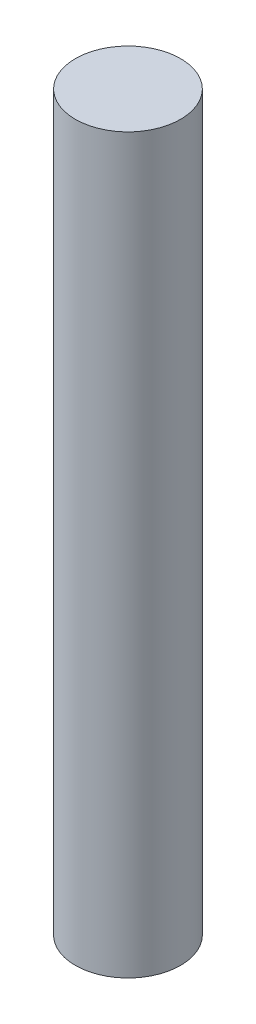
ISO-10303-21;
HEADER;
FILE_DESCRIPTION(('STEP AP214'),'2;1');
FILE_NAME('part.step','',(''),(''),'','','');
FILE_SCHEMA(('AUTOMOTIVE_DESIGN { 1 0 10303 214 1 1 1 1 }'));
ENDSEC;
DATA;
#1=APPLICATION_CONTEXT('core data for automotive mechanical design processes');
#2=APPLICATION_PROTOCOL_DEFINITION('international standard','automotive_design',2000,#1);
#3=PRODUCT_CONTEXT('',#1,'mechanical');
#4=PRODUCT('Part','Part','',(#3));
#5=PRODUCT_RELATED_PRODUCT_CATEGORY('part','',(#4));
#6=PRODUCT_DEFINITION_FORMATION('','',#4);
#7=PRODUCT_DEFINITION_CONTEXT('part definition',#1,'design');
#8=PRODUCT_DEFINITION('design','',#6,#7);
#9=PRODUCT_DEFINITION_SHAPE('','',#8);
#10=(LENGTH_UNIT() NAMED_UNIT(*) SI_UNIT(.MILLI.,.METRE.));
#11=(NAMED_UNIT(*) PLANE_ANGLE_UNIT() SI_UNIT($,.RADIAN.));
#12=(NAMED_UNIT(*) SI_UNIT($,.STERADIAN.) SOLID_ANGLE_UNIT());
#13=UNCERTAINTY_MEASURE_WITH_UNIT(LENGTH_MEASURE(1.E-05),#10,'distance_accuracy_value','');
#14=(GEOMETRIC_REPRESENTATION_CONTEXT(3) GLOBAL_UNCERTAINTY_ASSIGNED_CONTEXT((#13)) GLOBAL_UNIT_ASSIGNED_CONTEXT((#10,
#11,#12)) REPRESENTATION_CONTEXT('',''));
#15=CARTESIAN_POINT('',(0.,0.,0.));
#16=DIRECTION('',(0.,0.,1.));
#17=DIRECTION('',(1.,0.,0.));
#18=AXIS2_PLACEMENT_3D('',#15,#16,#17);
#19=CARTESIAN_POINT('',(0.,132.6642,0.));
#20=DIRECTION('',(0.,-1.,0.));
#21=DIRECTION('',(0.,0.,-1.));
#22=AXIS2_PLACEMENT_3D('',#19,#20,#21);
#23=CYLINDRICAL_SURFACE('',#22,9.525);
#24=CARTESIAN_POINT('',(0.,132.6642,0.));
#25=DIRECTION('',(0.,1.,0.));
#26=DIRECTION('',(0.,0.,1.));
#27=AXIS2_PLACEMENT_3D('',#24,#25,#26);
#28=CIRCLE('',#27,9.525);
#29=CARTESIAN_POINT('',(0.,132.6642,9.525));
#30=VERTEX_POINT('',#29);
#31=EDGE_CURVE('E10',#30,#30,#28,.T.);
#32=ORIENTED_EDGE('',*,*,#31,.F.);
#33=EDGE_LOOP('',(#32));
#34=FACE_BOUND('',#33,.T.);
#35=CARTESIAN_POINT('',(0.,0.,0.));
#36=DIRECTION('',(0.,1.,0.));
#37=DIRECTION('',(0.,0.,1.));
#38=AXIS2_PLACEMENT_3D('',#35,#36,#37);
#39=CIRCLE('',#38,9.525);
#40=CARTESIAN_POINT('',(0.,0.,9.525));
#41=VERTEX_POINT('',#40);
#42=EDGE_CURVE('E31',#41,#41,#39,.T.);
#43=ORIENTED_EDGE('',*,*,#42,.T.);
#44=EDGE_LOOP('',(#43));
#45=FACE_BOUND('',#44,.T.);
#46=ADVANCED_FACE('F28',(#34,#45),#23,.T.);
#47=CARTESIAN_POINT('',(0.,132.6642,0.));
#48=DIRECTION('',(0.,1.,0.));
#49=DIRECTION('',(0.,0.,1.));
#50=AXIS2_PLACEMENT_3D('',#47,#48,#49);
#51=PLANE('',#50);
#52=ORIENTED_EDGE('',*,*,#31,.T.);
#53=EDGE_LOOP('',(#52));
#54=FACE_BOUND('',#53,.T.);
#55=ADVANCED_FACE('F43',(#54),#51,.T.);
#56=CARTESIAN_POINT('',(0.,0.,0.));
#57=DIRECTION('',(0.,1.,0.));
#58=DIRECTION('',(0.,0.,1.));
#59=AXIS2_PLACEMENT_3D('',#56,#57,#58);
#60=PLANE('',#59);
#61=ORIENTED_EDGE('',*,*,#42,.F.);
#62=EDGE_LOOP('',(#61));
#63=FACE_BOUND('',#62,.T.);
#64=ADVANCED_FACE('F41',(#63),#60,.F.);
#65=CLOSED_SHELL('',(#46,#55,#64));
#66=MANIFOLD_SOLID_BREP('B2',#65);
#67=ADVANCED_BREP_SHAPE_REPRESENTATION('',(#18,#66),#14);
#68=SHAPE_DEFINITION_REPRESENTATION(#9,#67);
ENDSEC;
END-ISO-10303-21;
